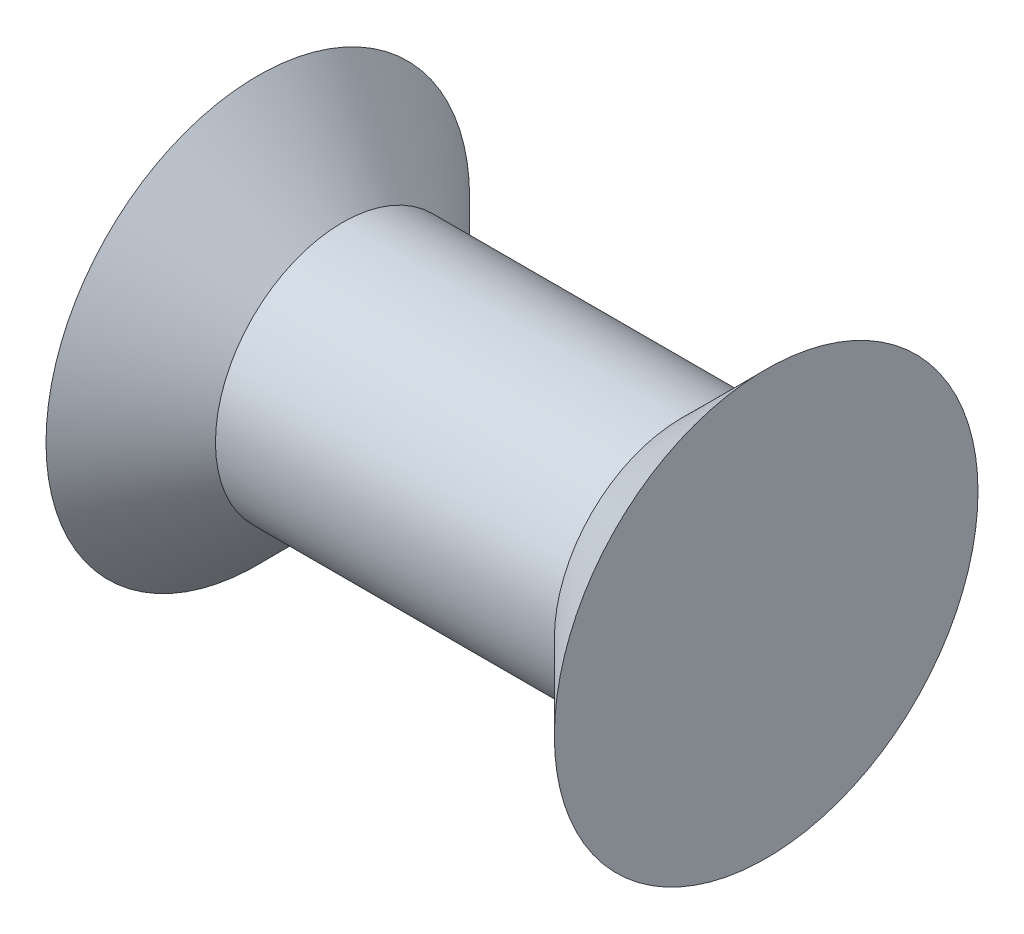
ISO-10303-21;
HEADER;
FILE_DESCRIPTION(('STEP AP214'),'2;1');
FILE_NAME('part.step','',(''),(''),'','','');
FILE_SCHEMA(('AUTOMOTIVE_DESIGN { 1 0 10303 214 1 1 1 1 }'));
ENDSEC;
DATA;
#1=APPLICATION_CONTEXT('core data for automotive mechanical design processes');
#2=APPLICATION_PROTOCOL_DEFINITION('international standard','automotive_design',2000,#1);
#3=PRODUCT_CONTEXT('',#1,'mechanical');
#4=PRODUCT('Part','Part','',(#3));
#5=PRODUCT_RELATED_PRODUCT_CATEGORY('part','',(#4));
#6=PRODUCT_DEFINITION_FORMATION('','',#4);
#7=PRODUCT_DEFINITION_CONTEXT('part definition',#1,'design');
#8=PRODUCT_DEFINITION('design','',#6,#7);
#9=PRODUCT_DEFINITION_SHAPE('','',#8);
#10=(LENGTH_UNIT() NAMED_UNIT(*) SI_UNIT(.MILLI.,.METRE.));
#11=(NAMED_UNIT(*) PLANE_ANGLE_UNIT() SI_UNIT($,.RADIAN.));
#12=(NAMED_UNIT(*) SI_UNIT($,.STERADIAN.) SOLID_ANGLE_UNIT());
#13=UNCERTAINTY_MEASURE_WITH_UNIT(LENGTH_MEASURE(1.E-05),#10,'distance_accuracy_value','');
#14=(GEOMETRIC_REPRESENTATION_CONTEXT(3) GLOBAL_UNCERTAINTY_ASSIGNED_CONTEXT((#13)) GLOBAL_UNIT_ASSIGNED_CONTEXT((#10,
#11,#12)) REPRESENTATION_CONTEXT('',''));
#15=CARTESIAN_POINT('',(0.,0.,0.));
#16=DIRECTION('',(0.,0.,1.));
#17=DIRECTION('',(1.,0.,0.));
#18=AXIS2_PLACEMENT_3D('',#15,#16,#17);
#19=CARTESIAN_POINT('',(-6.12694063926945,37.553564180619,0.));
#20=DIRECTION('',(-1.,0.,0.));
#21=DIRECTION('',(0.,0.,1.));
#22=AXIS2_PLACEMENT_3D('',#19,#20,#21);
#23=CONICAL_SURFACE('',#22,3.,0.785398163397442);
#24=CARTESIAN_POINT('',(-8.12694063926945,37.553564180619,0.));
#25=DIRECTION('',(-1.,0.,0.));
#26=DIRECTION('',(0.,0.,1.));
#27=AXIS2_PLACEMENT_3D('',#24,#25,#26);
#28=CIRCLE('',#27,4.99999999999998);
#29=CARTESIAN_POINT('',(-8.12694063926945,37.553564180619,4.99999999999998));
#30=VERTEX_POINT('',#29);
#31=EDGE_CURVE('E43',#30,#30,#28,.T.);
#32=ORIENTED_EDGE('',*,*,#31,.F.);
#33=EDGE_LOOP('',(#32));
#34=FACE_BOUND('',#33,.T.);
#35=CARTESIAN_POINT('',(-6.12694063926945,37.553564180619,0.));
#36=DIRECTION('',(-1.,0.,0.));
#37=DIRECTION('',(0.,0.,1.));
#38=AXIS2_PLACEMENT_3D('',#35,#36,#37);
#39=CIRCLE('',#38,3.);
#40=CARTESIAN_POINT('',(-6.12694063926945,37.553564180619,3.));
#41=VERTEX_POINT('',#40);
#42=EDGE_CURVE('E10',#41,#41,#39,.T.);
#43=ORIENTED_EDGE('',*,*,#42,.T.);
#44=EDGE_LOOP('',(#43));
#45=FACE_BOUND('',#44,.T.);
#46=ADVANCED_FACE('F29',(#34,#45),#23,.T.);
#47=CARTESIAN_POINT('',(-15.3508878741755,37.553564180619,0.));
#48=DIRECTION('',(-1.,0.,0.));
#49=DIRECTION('',(0.,0.,1.));
#50=AXIS2_PLACEMENT_3D('',#47,#48,#49);
#51=CYLINDRICAL_SURFACE('',#50,3.);
#52=ORIENTED_EDGE('',*,*,#42,.F.);
#53=EDGE_LOOP('',(#52));
#54=FACE_BOUND('',#53,.T.);
#55=CARTESIAN_POINT('',(1.87305936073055,37.553564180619,0.));
#56=DIRECTION('',(-1.,0.,0.));
#57=DIRECTION('',(0.,0.,1.));
#58=AXIS2_PLACEMENT_3D('',#55,#56,#57);
#59=CIRCLE('',#58,3.);
#60=CARTESIAN_POINT('',(1.87305936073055,37.553564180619,3.));
#61=VERTEX_POINT('',#60);
#62=EDGE_CURVE('E35',#61,#61,#59,.T.);
#63=ORIENTED_EDGE('',*,*,#62,.T.);
#64=EDGE_LOOP('',(#63));
#65=FACE_BOUND('',#64,.T.);
#66=ADVANCED_FACE('F52',(#54,#65),#51,.T.);
#67=CARTESIAN_POINT('',(3.87305936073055,37.553564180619,0.));
#68=DIRECTION('',(1.,0.,0.));
#69=DIRECTION('',(0.,0.,-1.));
#70=AXIS2_PLACEMENT_3D('',#67,#68,#69);
#71=CONICAL_SURFACE('',#70,5.,0.785398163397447);
#72=ORIENTED_EDGE('',*,*,#62,.F.);
#73=EDGE_LOOP('',(#72));
#74=FACE_BOUND('',#73,.T.);
#75=CARTESIAN_POINT('',(3.87305936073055,37.553564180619,0.));
#76=DIRECTION('',(-1.,0.,0.));
#77=DIRECTION('',(0.,0.,1.));
#78=AXIS2_PLACEMENT_3D('',#75,#76,#77);
#79=CIRCLE('',#78,5.);
#80=CARTESIAN_POINT('',(3.87305936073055,37.553564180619,5.));
#81=VERTEX_POINT('',#80);
#82=EDGE_CURVE('E39',#81,#81,#79,.T.);
#83=ORIENTED_EDGE('',*,*,#82,.T.);
#84=EDGE_LOOP('',(#83));
#85=FACE_BOUND('',#84,.T.);
#86=ADVANCED_FACE('F56',(#74,#85),#71,.T.);
#87=CARTESIAN_POINT('',(3.87305936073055,42.553564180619,0.));
#88=DIRECTION('',(-1.,0.,0.));
#89=DIRECTION('',(0.,0.,1.));
#90=AXIS2_PLACEMENT_3D('',#87,#88,#89);
#91=PLANE('',#90);
#92=ORIENTED_EDGE('',*,*,#82,.F.);
#93=EDGE_LOOP('',(#92));
#94=FACE_BOUND('',#93,.T.);
#95=ADVANCED_FACE('F61',(#94),#91,.F.);
#96=CARTESIAN_POINT('',(-8.12694063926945,42.553564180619,0.));
#97=DIRECTION('',(1.,0.,0.));
#98=DIRECTION('',(0.,0.,-1.));
#99=AXIS2_PLACEMENT_3D('',#96,#97,#98);
#100=PLANE('',#99);
#101=ORIENTED_EDGE('',*,*,#31,.T.);
#102=EDGE_LOOP('',(#101));
#103=FACE_BOUND('',#102,.T.);
#104=ADVANCED_FACE('F49',(#103),#100,.F.);
#105=CLOSED_SHELL('',(#46,#66,#86,#95,#104));
#106=MANIFOLD_SOLID_BREP('B2',#105);
#107=ADVANCED_BREP_SHAPE_REPRESENTATION('',(#18,#106),#14);
#108=SHAPE_DEFINITION_REPRESENTATION(#9,#107);
ENDSEC;
END-ISO-10303-21;
